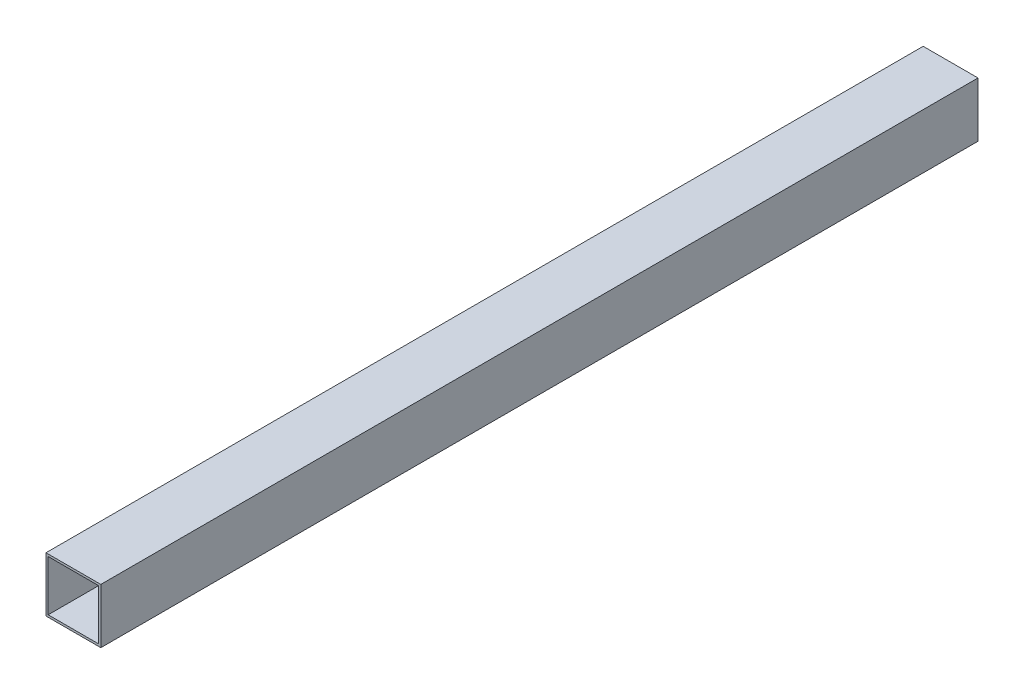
ISO-10303-21;
HEADER;
FILE_DESCRIPTION(('STEP AP214'),'2;1');
FILE_NAME('part.step','',(''),(''),'','','');
FILE_SCHEMA(('AUTOMOTIVE_DESIGN { 1 0 10303 214 1 1 1 1 }'));
ENDSEC;
DATA;
#1=APPLICATION_CONTEXT('core data for automotive mechanical design processes');
#2=APPLICATION_PROTOCOL_DEFINITION('international standard','automotive_design',2000,#1);
#3=PRODUCT_CONTEXT('',#1,'mechanical');
#4=PRODUCT('Part','Part','',(#3));
#5=PRODUCT_RELATED_PRODUCT_CATEGORY('part','',(#4));
#6=PRODUCT_DEFINITION_FORMATION('','',#4);
#7=PRODUCT_DEFINITION_CONTEXT('part definition',#1,'design');
#8=PRODUCT_DEFINITION('design','',#6,#7);
#9=PRODUCT_DEFINITION_SHAPE('','',#8);
#10=(LENGTH_UNIT() NAMED_UNIT(*) SI_UNIT(.MILLI.,.METRE.));
#11=(NAMED_UNIT(*) PLANE_ANGLE_UNIT() SI_UNIT($,.RADIAN.));
#12=(NAMED_UNIT(*) SI_UNIT($,.STERADIAN.) SOLID_ANGLE_UNIT());
#13=UNCERTAINTY_MEASURE_WITH_UNIT(LENGTH_MEASURE(1.E-05),#10,'distance_accuracy_value','');
#14=(GEOMETRIC_REPRESENTATION_CONTEXT(3) GLOBAL_UNCERTAINTY_ASSIGNED_CONTEXT((#13)) GLOBAL_UNIT_ASSIGNED_CONTEXT((#10,
#11,#12)) REPRESENTATION_CONTEXT('',''));
#15=CARTESIAN_POINT('',(0.,0.,0.));
#16=DIRECTION('',(0.,0.,1.));
#17=DIRECTION('',(1.,0.,0.));
#18=AXIS2_PLACEMENT_3D('',#15,#16,#17);
#19=CARTESIAN_POINT('',(0.,0.,800.));
#20=DIRECTION('',(0.,0.,1.));
#21=DIRECTION('',(1.,0.,0.));
#22=AXIS2_PLACEMENT_3D('',#19,#20,#21);
#23=PLANE('',#22);
#24=DIRECTION('',(0.,1.,0.));
#25=VECTOR('',#24,1.);
#26=CARTESIAN_POINT('',(25.,-25.,800.));
#27=LINE('',#26,#25);
#28=CARTESIAN_POINT('',(25.,-25.,800.));
#29=VERTEX_POINT('',#28);
#30=CARTESIAN_POINT('',(25.,25.,800.));
#31=VERTEX_POINT('',#30);
#32=EDGE_CURVE('E162',#29,#31,#27,.T.);
#33=ORIENTED_EDGE('',*,*,#32,.T.);
#34=DIRECTION('',(-1.,0.,0.));
#35=VECTOR('',#34,1.);
#36=CARTESIAN_POINT('',(-25.,25.,800.));
#37=LINE('',#36,#35);
#38=CARTESIAN_POINT('',(-25.,25.,800.));
#39=VERTEX_POINT('',#38);
#40=EDGE_CURVE('E165',#31,#39,#37,.T.);
#41=ORIENTED_EDGE('',*,*,#40,.T.);
#42=DIRECTION('',(0.,-1.,0.));
#43=VECTOR('',#42,1.);
#44=CARTESIAN_POINT('',(-25.,-25.,800.));
#45=LINE('',#44,#43);
#46=CARTESIAN_POINT('',(-25.,-25.,800.));
#47=VERTEX_POINT('',#46);
#48=EDGE_CURVE('E168',#39,#47,#45,.T.);
#49=ORIENTED_EDGE('',*,*,#48,.T.);
#50=DIRECTION('',(1.,0.,0.));
#51=VECTOR('',#50,1.);
#52=CARTESIAN_POINT('',(-25.,-25.,800.));
#53=LINE('',#52,#51);
#54=EDGE_CURVE('E170',#47,#29,#53,.T.);
#55=ORIENTED_EDGE('',*,*,#54,.T.);
#56=EDGE_LOOP('',(#33,#41,#49,#55));
#57=FACE_BOUND('',#56,.T.);
#58=DIRECTION('',(-1.,0.,0.));
#59=VECTOR('',#58,1.);
#60=CARTESIAN_POINT('',(0.,23.,800.));
#61=LINE('',#60,#59);
#62=CARTESIAN_POINT('',(23.,23.,800.));
#63=VERTEX_POINT('',#62);
#64=CARTESIAN_POINT('',(-23.,23.,800.));
#65=VERTEX_POINT('',#64);
#66=EDGE_CURVE('E134',#63,#65,#61,.T.);
#67=ORIENTED_EDGE('',*,*,#66,.F.);
#68=DIRECTION('',(0.,1.,0.));
#69=VECTOR('',#68,1.);
#70=CARTESIAN_POINT('',(23.,0.,800.));
#71=LINE('',#70,#69);
#72=CARTESIAN_POINT('',(23.,-23.,800.));
#73=VERTEX_POINT('',#72);
#74=EDGE_CURVE('E126',#73,#63,#71,.T.);
#75=ORIENTED_EDGE('',*,*,#74,.F.);
#76=DIRECTION('',(1.,0.,0.));
#77=VECTOR('',#76,1.);
#78=CARTESIAN_POINT('',(0.,-23.,800.));
#79=LINE('',#78,#77);
#80=CARTESIAN_POINT('',(-23.,-23.,800.));
#81=VERTEX_POINT('',#80);
#82=EDGE_CURVE('E148',#81,#73,#79,.T.);
#83=ORIENTED_EDGE('',*,*,#82,.F.);
#84=DIRECTION('',(0.,-1.,0.));
#85=VECTOR('',#84,1.);
#86=CARTESIAN_POINT('',(-23.,0.,800.));
#87=LINE('',#86,#85);
#88=EDGE_CURVE('E146',#65,#81,#87,.T.);
#89=ORIENTED_EDGE('',*,*,#88,.F.);
#90=EDGE_LOOP('',(#67,#75,#83,#89));
#91=FACE_BOUND('',#90,.T.);
#92=ADVANCED_FACE('F61',(#57,#91),#23,.T.);
#93=CARTESIAN_POINT('',(0.,0.,0.));
#94=DIRECTION('',(0.,0.,1.));
#95=DIRECTION('',(1.,0.,0.));
#96=AXIS2_PLACEMENT_3D('',#93,#94,#95);
#97=PLANE('',#96);
#98=DIRECTION('',(0.,1.,0.));
#99=VECTOR('',#98,1.);
#100=CARTESIAN_POINT('',(25.,-25.,0.));
#101=LINE('',#100,#99);
#102=CARTESIAN_POINT('',(25.,-25.,0.));
#103=VERTEX_POINT('',#102);
#104=CARTESIAN_POINT('',(25.,25.,0.));
#105=VERTEX_POINT('',#104);
#106=EDGE_CURVE('E142',#103,#105,#101,.T.);
#107=ORIENTED_EDGE('',*,*,#106,.F.);
#108=DIRECTION('',(1.,0.,0.));
#109=VECTOR('',#108,1.);
#110=CARTESIAN_POINT('',(-25.,-25.,0.));
#111=LINE('',#110,#109);
#112=CARTESIAN_POINT('',(-25.,-25.,0.));
#113=VERTEX_POINT('',#112);
#114=EDGE_CURVE('E166',#113,#103,#111,.T.);
#115=ORIENTED_EDGE('',*,*,#114,.F.);
#116=DIRECTION('',(0.,-1.,0.));
#117=VECTOR('',#116,1.);
#118=CARTESIAN_POINT('',(-25.,-25.,0.));
#119=LINE('',#118,#117);
#120=CARTESIAN_POINT('',(-25.,25.,0.));
#121=VERTEX_POINT('',#120);
#122=EDGE_CURVE('E177',#121,#113,#119,.T.);
#123=ORIENTED_EDGE('',*,*,#122,.F.);
#124=DIRECTION('',(-1.,0.,0.));
#125=VECTOR('',#124,1.);
#126=CARTESIAN_POINT('',(-25.,25.,0.));
#127=LINE('',#126,#125);
#128=EDGE_CURVE('E175',#105,#121,#127,.T.);
#129=ORIENTED_EDGE('',*,*,#128,.F.);
#130=EDGE_LOOP('',(#107,#115,#123,#129));
#131=FACE_BOUND('',#130,.T.);
#132=DIRECTION('',(0.,1.,0.));
#133=VECTOR('',#132,1.);
#134=CARTESIAN_POINT('',(23.,0.,0.));
#135=LINE('',#134,#133);
#136=CARTESIAN_POINT('',(23.,-23.,0.));
#137=VERTEX_POINT('',#136);
#138=CARTESIAN_POINT('',(23.,23.,0.));
#139=VERTEX_POINT('',#138);
#140=EDGE_CURVE('E84',#137,#139,#135,.T.);
#141=ORIENTED_EDGE('',*,*,#140,.T.);
#142=DIRECTION('',(-1.,0.,0.));
#143=VECTOR('',#142,1.);
#144=CARTESIAN_POINT('',(0.,23.,0.));
#145=LINE('',#144,#143);
#146=CARTESIAN_POINT('',(-23.,23.,0.));
#147=VERTEX_POINT('',#146);
#148=EDGE_CURVE('E141',#139,#147,#145,.T.);
#149=ORIENTED_EDGE('',*,*,#148,.T.);
#150=DIRECTION('',(0.,-1.,0.));
#151=VECTOR('',#150,1.);
#152=CARTESIAN_POINT('',(-23.,0.,0.));
#153=LINE('',#152,#151);
#154=CARTESIAN_POINT('',(-23.,-23.,0.));
#155=VERTEX_POINT('',#154);
#156=EDGE_CURVE('E154',#147,#155,#153,.T.);
#157=ORIENTED_EDGE('',*,*,#156,.T.);
#158=DIRECTION('',(1.,0.,0.));
#159=VECTOR('',#158,1.);
#160=CARTESIAN_POINT('',(0.,-23.,0.));
#161=LINE('',#160,#159);
#162=EDGE_CURVE('E135',#155,#137,#161,.T.);
#163=ORIENTED_EDGE('',*,*,#162,.T.);
#164=EDGE_LOOP('',(#141,#149,#157,#163));
#165=FACE_BOUND('',#164,.T.);
#166=ADVANCED_FACE('F195',(#131,#165),#97,.F.);
#167=CARTESIAN_POINT('',(25.,-25.,800.));
#168=DIRECTION('',(-1.,0.,0.));
#169=DIRECTION('',(0.,0.,1.));
#170=AXIS2_PLACEMENT_3D('',#167,#168,#169);
#171=PLANE('',#170);
#172=ORIENTED_EDGE('',*,*,#106,.T.);
#173=DIRECTION('',(0.,0.,-1.));
#174=VECTOR('',#173,1.);
#175=CARTESIAN_POINT('',(25.,25.,800.));
#176=LINE('',#175,#174);
#177=EDGE_CURVE('E12',#31,#105,#176,.T.);
#178=ORIENTED_EDGE('',*,*,#177,.F.);
#179=ORIENTED_EDGE('',*,*,#32,.F.);
#180=DIRECTION('',(0.,0.,-1.));
#181=VECTOR('',#180,1.);
#182=CARTESIAN_POINT('',(25.,-25.,800.));
#183=LINE('',#182,#181);
#184=EDGE_CURVE('E172',#29,#103,#183,.T.);
#185=ORIENTED_EDGE('',*,*,#184,.T.);
#186=EDGE_LOOP('',(#172,#178,#179,#185));
#187=FACE_BOUND('',#186,.T.);
#188=ADVANCED_FACE('F63',(#187),#171,.F.);
#189=CARTESIAN_POINT('',(-25.,25.,800.));
#190=DIRECTION('',(0.,-1.,0.));
#191=DIRECTION('',(0.,0.,-1.));
#192=AXIS2_PLACEMENT_3D('',#189,#190,#191);
#193=PLANE('',#192);
#194=ORIENTED_EDGE('',*,*,#128,.T.);
#195=DIRECTION('',(0.,0.,-1.));
#196=VECTOR('',#195,1.);
#197=CARTESIAN_POINT('',(-25.,25.,800.));
#198=LINE('',#197,#196);
#199=EDGE_CURVE('E69',#39,#121,#198,.T.);
#200=ORIENTED_EDGE('',*,*,#199,.F.);
#201=ORIENTED_EDGE('',*,*,#40,.F.);
#202=ORIENTED_EDGE('',*,*,#177,.T.);
#203=EDGE_LOOP('',(#194,#200,#201,#202));
#204=FACE_BOUND('',#203,.T.);
#205=ADVANCED_FACE('F205',(#204),#193,.F.);
#206=CARTESIAN_POINT('',(-25.,-25.,800.));
#207=DIRECTION('',(1.,0.,0.));
#208=DIRECTION('',(0.,0.,-1.));
#209=AXIS2_PLACEMENT_3D('',#206,#207,#208);
#210=PLANE('',#209);
#211=ORIENTED_EDGE('',*,*,#122,.T.);
#212=DIRECTION('',(0.,0.,-1.));
#213=VECTOR('',#212,1.);
#214=CARTESIAN_POINT('',(-25.,-25.,800.));
#215=LINE('',#214,#213);
#216=EDGE_CURVE('E182',#47,#113,#215,.T.);
#217=ORIENTED_EDGE('',*,*,#216,.F.);
#218=ORIENTED_EDGE('',*,*,#48,.F.);
#219=ORIENTED_EDGE('',*,*,#199,.T.);
#220=EDGE_LOOP('',(#211,#217,#218,#219));
#221=FACE_BOUND('',#220,.T.);
#222=ADVANCED_FACE('F189',(#221),#210,.F.);
#223=CARTESIAN_POINT('',(-25.,-25.,800.));
#224=DIRECTION('',(0.,1.,0.));
#225=DIRECTION('',(0.,0.,1.));
#226=AXIS2_PLACEMENT_3D('',#223,#224,#225);
#227=PLANE('',#226);
#228=ORIENTED_EDGE('',*,*,#114,.T.);
#229=ORIENTED_EDGE('',*,*,#184,.F.);
#230=ORIENTED_EDGE('',*,*,#54,.F.);
#231=ORIENTED_EDGE('',*,*,#216,.T.);
#232=EDGE_LOOP('',(#228,#229,#230,#231));
#233=FACE_BOUND('',#232,.T.);
#234=ADVANCED_FACE('F199',(#233),#227,.F.);
#235=CARTESIAN_POINT('',(23.,0.,800.));
#236=DIRECTION('',(-1.,0.,0.));
#237=DIRECTION('',(0.,0.,1.));
#238=AXIS2_PLACEMENT_3D('',#235,#236,#237);
#239=PLANE('',#238);
#240=ORIENTED_EDGE('',*,*,#140,.F.);
#241=DIRECTION('',(0.,0.,-1.));
#242=VECTOR('',#241,1.);
#243=CARTESIAN_POINT('',(23.,-23.,800.));
#244=LINE('',#243,#242);
#245=EDGE_CURVE('E130',#73,#137,#244,.T.);
#246=ORIENTED_EDGE('',*,*,#245,.F.);
#247=ORIENTED_EDGE('',*,*,#74,.T.);
#248=DIRECTION('',(0.,0.,-1.));
#249=VECTOR('',#248,1.);
#250=CARTESIAN_POINT('',(23.,23.,800.));
#251=LINE('',#250,#249);
#252=EDGE_CURVE('E129',#63,#139,#251,.T.);
#253=ORIENTED_EDGE('',*,*,#252,.T.);
#254=EDGE_LOOP('',(#240,#246,#247,#253));
#255=FACE_BOUND('',#254,.T.);
#256=ADVANCED_FACE('F128',(#255),#239,.T.);
#257=CARTESIAN_POINT('',(0.,23.,800.));
#258=DIRECTION('',(0.,-1.,0.));
#259=DIRECTION('',(0.,0.,-1.));
#260=AXIS2_PLACEMENT_3D('',#257,#258,#259);
#261=PLANE('',#260);
#262=ORIENTED_EDGE('',*,*,#148,.F.);
#263=ORIENTED_EDGE('',*,*,#252,.F.);
#264=ORIENTED_EDGE('',*,*,#66,.T.);
#265=DIRECTION('',(0.,0.,-1.));
#266=VECTOR('',#265,1.);
#267=CARTESIAN_POINT('',(-23.,23.,800.));
#268=LINE('',#267,#266);
#269=EDGE_CURVE('E143',#65,#147,#268,.T.);
#270=ORIENTED_EDGE('',*,*,#269,.T.);
#271=EDGE_LOOP('',(#262,#263,#264,#270));
#272=FACE_BOUND('',#271,.T.);
#273=ADVANCED_FACE('F138',(#272),#261,.T.);
#274=CARTESIAN_POINT('',(-23.,0.,800.));
#275=DIRECTION('',(1.,0.,0.));
#276=DIRECTION('',(0.,0.,-1.));
#277=AXIS2_PLACEMENT_3D('',#274,#275,#276);
#278=PLANE('',#277);
#279=ORIENTED_EDGE('',*,*,#156,.F.);
#280=ORIENTED_EDGE('',*,*,#269,.F.);
#281=ORIENTED_EDGE('',*,*,#88,.T.);
#282=DIRECTION('',(0.,0.,-1.));
#283=VECTOR('',#282,1.);
#284=CARTESIAN_POINT('',(-23.,-23.,800.));
#285=LINE('',#284,#283);
#286=EDGE_CURVE('E76',#81,#155,#285,.T.);
#287=ORIENTED_EDGE('',*,*,#286,.T.);
#288=EDGE_LOOP('',(#279,#280,#281,#287));
#289=FACE_BOUND('',#288,.T.);
#290=ADVANCED_FACE('F228',(#289),#278,.T.);
#291=CARTESIAN_POINT('',(0.,-23.,800.));
#292=DIRECTION('',(0.,1.,0.));
#293=DIRECTION('',(0.,0.,1.));
#294=AXIS2_PLACEMENT_3D('',#291,#292,#293);
#295=PLANE('',#294);
#296=ORIENTED_EDGE('',*,*,#162,.F.);
#297=ORIENTED_EDGE('',*,*,#286,.F.);
#298=ORIENTED_EDGE('',*,*,#82,.T.);
#299=ORIENTED_EDGE('',*,*,#245,.T.);
#300=EDGE_LOOP('',(#296,#297,#298,#299));
#301=FACE_BOUND('',#300,.T.);
#302=ADVANCED_FACE('F232',(#301),#295,.T.);
#303=CLOSED_SHELL('',(#92,#166,#188,#205,#222,#234,#256,#273,#290,#302));
#304=MANIFOLD_SOLID_BREP('B2',#303);
#305=ADVANCED_BREP_SHAPE_REPRESENTATION('',(#18,#304),#14);
#306=SHAPE_DEFINITION_REPRESENTATION(#9,#305);
ENDSEC;
END-ISO-10303-21;
